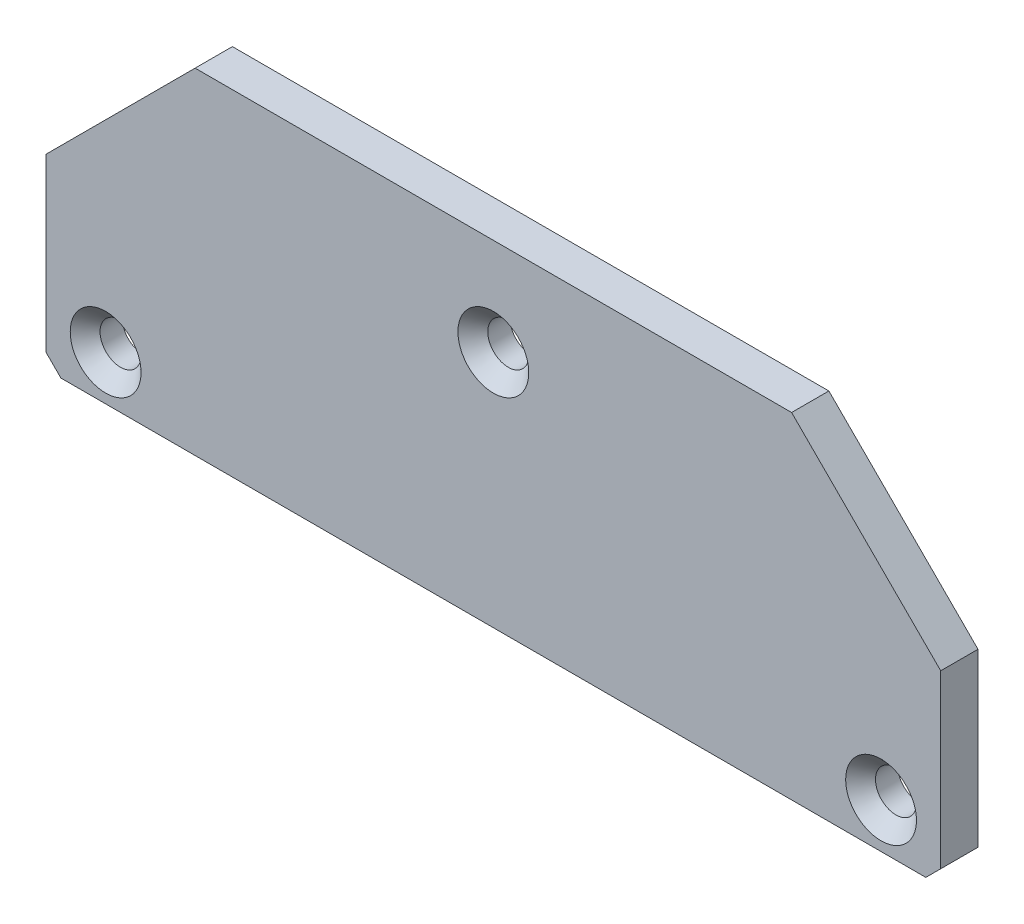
ISO-10303-21;
HEADER;
FILE_DESCRIPTION(('STEP AP214'),'2;1');
FILE_NAME('part.step','',(''),(''),'','','');
FILE_SCHEMA(('AUTOMOTIVE_DESIGN { 1 0 10303 214 1 1 1 1 }'));
ENDSEC;
DATA;
#1=APPLICATION_CONTEXT('core data for automotive mechanical design processes');
#2=APPLICATION_PROTOCOL_DEFINITION('international standard','automotive_design',2000,#1);
#3=PRODUCT_CONTEXT('',#1,'mechanical');
#4=PRODUCT('Part','Part','',(#3));
#5=PRODUCT_RELATED_PRODUCT_CATEGORY('part','',(#4));
#6=PRODUCT_DEFINITION_FORMATION('','',#4);
#7=PRODUCT_DEFINITION_CONTEXT('part definition',#1,'design');
#8=PRODUCT_DEFINITION('design','',#6,#7);
#9=PRODUCT_DEFINITION_SHAPE('','',#8);
#10=(LENGTH_UNIT() NAMED_UNIT(*) SI_UNIT(.MILLI.,.METRE.));
#11=(NAMED_UNIT(*) PLANE_ANGLE_UNIT() SI_UNIT($,.RADIAN.));
#12=(NAMED_UNIT(*) SI_UNIT($,.STERADIAN.) SOLID_ANGLE_UNIT());
#13=UNCERTAINTY_MEASURE_WITH_UNIT(LENGTH_MEASURE(1.E-05),#10,'distance_accuracy_value','');
#14=(GEOMETRIC_REPRESENTATION_CONTEXT(3) GLOBAL_UNCERTAINTY_ASSIGNED_CONTEXT((#13)) GLOBAL_UNIT_ASSIGNED_CONTEXT((#10,
#11,#12)) REPRESENTATION_CONTEXT('',''));
#15=CARTESIAN_POINT('',(0.,0.,0.));
#16=DIRECTION('',(0.,0.,1.));
#17=DIRECTION('',(1.,0.,0.));
#18=AXIS2_PLACEMENT_3D('',#15,#16,#17);
#19=CARTESIAN_POINT('',(60.,12.9332392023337,-7.));
#20=DIRECTION('',(0.,0.,-1.));
#21=DIRECTION('',(-1.,0.,0.));
#22=AXIS2_PLACEMENT_3D('',#19,#20,#21);
#23=PLANE('',#22);
#24=CARTESIAN_POINT('',(-52.,18.9332392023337,-7.));
#25=DIRECTION('',(0.,0.,-1.));
#26=DIRECTION('',(-1.,0.,0.));
#27=AXIS2_PLACEMENT_3D('',#24,#25,#26);
#28=CIRCLE('',#27,2.75);
#29=CARTESIAN_POINT('',(-54.75,18.9332392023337,-7.));
#30=VERTEX_POINT('',#29);
#31=EDGE_CURVE('E240',#30,#30,#28,.T.);
#32=ORIENTED_EDGE('',*,*,#31,.F.);
#33=EDGE_LOOP('',(#32));
#34=FACE_BOUND('',#33,.T.);
#35=DIRECTION('',(0.,-1.,0.));
#36=VECTOR('',#35,1.);
#37=CARTESIAN_POINT('',(60.,37.9332392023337,-7.));
#38=LINE('',#37,#36);
#39=CARTESIAN_POINT('',(60.,37.9332392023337,-7.));
#40=VERTEX_POINT('',#39);
#41=CARTESIAN_POINT('',(60.,14.9332392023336,-7.));
#42=VERTEX_POINT('',#41);
#43=EDGE_CURVE('E142',#40,#42,#38,.T.);
#44=ORIENTED_EDGE('',*,*,#43,.T.);
#45=DIRECTION('',(0.707106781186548,0.707106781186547,0.));
#46=VECTOR('',#45,1.);
#47=CARTESIAN_POINT('',(59.,13.9332392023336,-7.));
#48=LINE('',#47,#46);
#49=CARTESIAN_POINT('',(58.,12.9332392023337,-7.));
#50=VERTEX_POINT('',#49);
#51=EDGE_CURVE('E41',#42,#50,#48,.F.);
#52=ORIENTED_EDGE('',*,*,#51,.T.);
#53=DIRECTION('',(-1.,0.,0.));
#54=VECTOR('',#53,1.);
#55=CARTESIAN_POINT('',(60.,12.9332392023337,-7.));
#56=LINE('',#55,#54);
#57=CARTESIAN_POINT('',(-58.,12.9332392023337,-7.));
#58=VERTEX_POINT('',#57);
#59=EDGE_CURVE('E106',#50,#58,#56,.T.);
#60=ORIENTED_EDGE('',*,*,#59,.T.);
#61=DIRECTION('',(0.70710678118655,-0.707106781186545,0.));
#62=VECTOR('',#61,1.);
#63=CARTESIAN_POINT('',(1.00000000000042,-46.0667607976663,-7.));
#64=LINE('',#63,#62);
#65=CARTESIAN_POINT('',(-60.,14.9332392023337,-7.));
#66=VERTEX_POINT('',#65);
#67=EDGE_CURVE('E48',#58,#66,#64,.F.);
#68=ORIENTED_EDGE('',*,*,#67,.T.);
#69=DIRECTION('',(0.,1.,0.));
#70=VECTOR('',#69,1.);
#71=CARTESIAN_POINT('',(-60.,12.9332392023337,-7.));
#72=LINE('',#71,#70);
#73=CARTESIAN_POINT('',(-60.,37.9332392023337,-7.));
#74=VERTEX_POINT('',#73);
#75=EDGE_CURVE('E98',#66,#74,#72,.T.);
#76=ORIENTED_EDGE('',*,*,#75,.T.);
#77=DIRECTION('',(0.707106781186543,0.707106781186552,0.));
#78=VECTOR('',#77,1.);
#79=CARTESIAN_POINT('',(-60.,37.9332392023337,-7.));
#80=LINE('',#79,#78);
#81=CARTESIAN_POINT('',(-40.0000000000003,57.9332392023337,-7.));
#82=VERTEX_POINT('',#81);
#83=EDGE_CURVE('E102',#74,#82,#80,.T.);
#84=ORIENTED_EDGE('',*,*,#83,.T.);
#85=DIRECTION('',(1.,0.,0.));
#86=VECTOR('',#85,1.);
#87=CARTESIAN_POINT('',(-40.0000000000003,57.9332392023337,-7.));
#88=LINE('',#87,#86);
#89=CARTESIAN_POINT('',(40.0000000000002,57.9332392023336,-7.));
#90=VERTEX_POINT('',#89);
#91=EDGE_CURVE('E121',#82,#90,#88,.T.);
#92=ORIENTED_EDGE('',*,*,#91,.T.);
#93=DIRECTION('',(0.707106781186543,-0.707106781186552,0.));
#94=VECTOR('',#93,1.);
#95=CARTESIAN_POINT('',(60.,37.9332392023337,-7.));
#96=LINE('',#95,#94);
#97=EDGE_CURVE('E123',#90,#40,#96,.T.);
#98=ORIENTED_EDGE('',*,*,#97,.T.);
#99=EDGE_LOOP('',(#44,#52,#60,#68,#76,#84,#92,#98));
#100=FACE_BOUND('',#99,.T.);
#101=CARTESIAN_POINT('',(52.,18.9332392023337,-7.));
#102=DIRECTION('',(0.,0.,-1.));
#103=DIRECTION('',(-1.,0.,0.));
#104=AXIS2_PLACEMENT_3D('',#101,#102,#103);
#105=CIRCLE('',#104,2.75);
#106=CARTESIAN_POINT('',(49.25,18.9332392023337,-7.));
#107=VERTEX_POINT('',#106);
#108=EDGE_CURVE('E132',#107,#107,#105,.T.);
#109=ORIENTED_EDGE('',*,*,#108,.F.);
#110=EDGE_LOOP('',(#109));
#111=FACE_BOUND('',#110,.T.);
#112=CARTESIAN_POINT('',(0.,44.9332392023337,-7.));
#113=DIRECTION('',(0.,0.,-1.));
#114=DIRECTION('',(-1.,0.,0.));
#115=AXIS2_PLACEMENT_3D('',#112,#113,#114);
#116=CIRCLE('',#115,2.75);
#117=CARTESIAN_POINT('',(-2.75,44.9332392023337,-7.));
#118=VERTEX_POINT('',#117);
#119=EDGE_CURVE('E238',#118,#118,#116,.T.);
#120=ORIENTED_EDGE('',*,*,#119,.F.);
#121=EDGE_LOOP('',(#120));
#122=FACE_BOUND('',#121,.T.);
#123=ADVANCED_FACE('F33',(#34,#100,#111,#122),#23,.T.);
#124=CARTESIAN_POINT('',(60.,12.9332392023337,-2.));
#125=DIRECTION('',(0.,0.,-1.));
#126=DIRECTION('',(-1.,0.,0.));
#127=AXIS2_PLACEMENT_3D('',#124,#125,#126);
#128=PLANE('',#127);
#129=CARTESIAN_POINT('',(52.,18.9332392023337,-2.));
#130=DIRECTION('',(0.,0.,-1.));
#131=DIRECTION('',(-1.,0.,0.));
#132=AXIS2_PLACEMENT_3D('',#129,#130,#131);
#133=CIRCLE('',#132,4.74999999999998);
#134=CARTESIAN_POINT('',(47.25,18.9332392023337,-2.));
#135=VERTEX_POINT('',#134);
#136=EDGE_CURVE('E154',#135,#135,#133,.T.);
#137=ORIENTED_EDGE('',*,*,#136,.T.);
#138=EDGE_LOOP('',(#137));
#139=FACE_BOUND('',#138,.T.);
#140=CARTESIAN_POINT('',(0.,44.9332392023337,-2.));
#141=DIRECTION('',(0.,0.,-1.));
#142=DIRECTION('',(-1.,0.,0.));
#143=AXIS2_PLACEMENT_3D('',#140,#141,#142);
#144=CIRCLE('',#143,4.74999999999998);
#145=CARTESIAN_POINT('',(-4.74999999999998,44.9332392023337,-2.));
#146=VERTEX_POINT('',#145);
#147=EDGE_CURVE('E151',#146,#146,#144,.T.);
#148=ORIENTED_EDGE('',*,*,#147,.T.);
#149=EDGE_LOOP('',(#148));
#150=FACE_BOUND('',#149,.T.);
#151=CARTESIAN_POINT('',(-52.,18.9332392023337,-2.));
#152=DIRECTION('',(0.,0.,-1.));
#153=DIRECTION('',(-1.,0.,0.));
#154=AXIS2_PLACEMENT_3D('',#151,#152,#153);
#155=CIRCLE('',#154,4.74999999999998);
#156=CARTESIAN_POINT('',(-56.75,18.9332392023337,-2.));
#157=VERTEX_POINT('',#156);
#158=EDGE_CURVE('E115',#157,#157,#155,.T.);
#159=ORIENTED_EDGE('',*,*,#158,.T.);
#160=EDGE_LOOP('',(#159));
#161=FACE_BOUND('',#160,.T.);
#162=DIRECTION('',(-1.,0.,0.));
#163=VECTOR('',#162,1.);
#164=CARTESIAN_POINT('',(60.,12.9332392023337,-2.));
#165=LINE('',#164,#163);
#166=CARTESIAN_POINT('',(58.,12.9332392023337,-2.));
#167=VERTEX_POINT('',#166);
#168=CARTESIAN_POINT('',(-58.,12.9332392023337,-2.));
#169=VERTEX_POINT('',#168);
#170=EDGE_CURVE('E131',#167,#169,#165,.T.);
#171=ORIENTED_EDGE('',*,*,#170,.F.);
#172=DIRECTION('',(-0.707106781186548,-0.707106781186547,0.));
#173=VECTOR('',#172,1.);
#174=CARTESIAN_POINT('',(58.,12.9332392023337,-2.));
#175=LINE('',#174,#173);
#176=CARTESIAN_POINT('',(60.,14.9332392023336,-2.));
#177=VERTEX_POINT('',#176);
#178=EDGE_CURVE('E173',#167,#177,#175,.F.);
#179=ORIENTED_EDGE('',*,*,#178,.T.);
#180=DIRECTION('',(0.,-1.,0.));
#181=VECTOR('',#180,1.);
#182=CARTESIAN_POINT('',(60.,37.9332392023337,-2.));
#183=LINE('',#182,#181);
#184=CARTESIAN_POINT('',(60.,37.9332392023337,-2.));
#185=VERTEX_POINT('',#184);
#186=EDGE_CURVE('E129',#185,#177,#183,.T.);
#187=ORIENTED_EDGE('',*,*,#186,.F.);
#188=DIRECTION('',(0.707106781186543,-0.707106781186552,0.));
#189=VECTOR('',#188,1.);
#190=CARTESIAN_POINT('',(60.,37.9332392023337,-2.));
#191=LINE('',#190,#189);
#192=CARTESIAN_POINT('',(40.0000000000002,57.9332392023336,-2.));
#193=VERTEX_POINT('',#192);
#194=EDGE_CURVE('E140',#193,#185,#191,.T.);
#195=ORIENTED_EDGE('',*,*,#194,.F.);
#196=DIRECTION('',(1.,0.,0.));
#197=VECTOR('',#196,1.);
#198=CARTESIAN_POINT('',(-40.0000000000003,57.9332392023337,-2.));
#199=LINE('',#198,#197);
#200=CARTESIAN_POINT('',(-40.0000000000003,57.9332392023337,-2.));
#201=VERTEX_POINT('',#200);
#202=EDGE_CURVE('E138',#201,#193,#199,.T.);
#203=ORIENTED_EDGE('',*,*,#202,.F.);
#204=DIRECTION('',(0.707106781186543,0.707106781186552,0.));
#205=VECTOR('',#204,1.);
#206=CARTESIAN_POINT('',(-60.,37.9332392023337,-2.));
#207=LINE('',#206,#205);
#208=CARTESIAN_POINT('',(-60.,37.9332392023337,-2.));
#209=VERTEX_POINT('',#208);
#210=EDGE_CURVE('E136',#209,#201,#207,.T.);
#211=ORIENTED_EDGE('',*,*,#210,.F.);
#212=DIRECTION('',(0.,1.,0.));
#213=VECTOR('',#212,1.);
#214=CARTESIAN_POINT('',(-60.,12.9332392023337,-2.));
#215=LINE('',#214,#213);
#216=CARTESIAN_POINT('',(-60.,14.9332392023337,-2.));
#217=VERTEX_POINT('',#216);
#218=EDGE_CURVE('E112',#217,#209,#215,.T.);
#219=ORIENTED_EDGE('',*,*,#218,.F.);
#220=DIRECTION('',(-0.70710678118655,0.707106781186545,0.));
#221=VECTOR('',#220,1.);
#222=CARTESIAN_POINT('',(-60.,14.9332392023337,-2.));
#223=LINE('',#222,#221);
#224=EDGE_CURVE('E171',#217,#169,#223,.F.);
#225=ORIENTED_EDGE('',*,*,#224,.T.);
#226=EDGE_LOOP('',(#171,#179,#187,#195,#203,#211,#219,#225));
#227=FACE_BOUND('',#226,.T.);
#228=ADVANCED_FACE('F187',(#139,#150,#161,#227),#128,.F.);
#229=CARTESIAN_POINT('',(60.,37.9332392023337,-7.));
#230=DIRECTION('',(-1.,0.,0.));
#231=DIRECTION('',(0.,0.,1.));
#232=AXIS2_PLACEMENT_3D('',#229,#230,#231);
#233=PLANE('',#232);
#234=ORIENTED_EDGE('',*,*,#186,.T.);
#235=DIRECTION('',(0.,0.,-1.));
#236=VECTOR('',#235,1.);
#237=CARTESIAN_POINT('',(60.,14.9332392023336,-7.));
#238=LINE('',#237,#236);
#239=EDGE_CURVE('E56',#177,#42,#238,.T.);
#240=ORIENTED_EDGE('',*,*,#239,.T.);
#241=ORIENTED_EDGE('',*,*,#43,.F.);
#242=DIRECTION('',(0.,0.,1.));
#243=VECTOR('',#242,1.);
#244=CARTESIAN_POINT('',(60.,37.9332392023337,-7.));
#245=LINE('',#244,#243);
#246=EDGE_CURVE('E128',#40,#185,#245,.T.);
#247=ORIENTED_EDGE('',*,*,#246,.T.);
#248=EDGE_LOOP('',(#234,#240,#241,#247));
#249=FACE_BOUND('',#248,.T.);
#250=ADVANCED_FACE('F189',(#249),#233,.F.);
#251=CARTESIAN_POINT('',(60.,12.9332392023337,-7.));
#252=DIRECTION('',(0.,1.,0.));
#253=DIRECTION('',(0.,0.,1.));
#254=AXIS2_PLACEMENT_3D('',#251,#252,#253);
#255=PLANE('',#254);
#256=ORIENTED_EDGE('',*,*,#59,.F.);
#257=DIRECTION('',(0.,0.,1.));
#258=VECTOR('',#257,1.);
#259=CARTESIAN_POINT('',(58.,12.9332392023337,-7.));
#260=LINE('',#259,#258);
#261=EDGE_CURVE('E168',#50,#167,#260,.T.);
#262=ORIENTED_EDGE('',*,*,#261,.T.);
#263=ORIENTED_EDGE('',*,*,#170,.T.);
#264=DIRECTION('',(0.,0.,-1.));
#265=VECTOR('',#264,1.);
#266=CARTESIAN_POINT('',(-58.,12.9332392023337,-7.));
#267=LINE('',#266,#265);
#268=EDGE_CURVE('E166',#169,#58,#267,.T.);
#269=ORIENTED_EDGE('',*,*,#268,.T.);
#270=EDGE_LOOP('',(#256,#262,#263,#269));
#271=FACE_BOUND('',#270,.T.);
#272=ADVANCED_FACE('F181',(#271),#255,.F.);
#273=CARTESIAN_POINT('',(-60.,12.9332392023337,-7.));
#274=DIRECTION('',(1.,0.,0.));
#275=DIRECTION('',(0.,0.,-1.));
#276=AXIS2_PLACEMENT_3D('',#273,#274,#275);
#277=PLANE('',#276);
#278=ORIENTED_EDGE('',*,*,#75,.F.);
#279=DIRECTION('',(0.,0.,1.));
#280=VECTOR('',#279,1.);
#281=CARTESIAN_POINT('',(-60.,14.9332392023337,-7.));
#282=LINE('',#281,#280);
#283=EDGE_CURVE('E11',#66,#217,#282,.T.);
#284=ORIENTED_EDGE('',*,*,#283,.T.);
#285=ORIENTED_EDGE('',*,*,#218,.T.);
#286=DIRECTION('',(0.,0.,1.));
#287=VECTOR('',#286,1.);
#288=CARTESIAN_POINT('',(-60.,37.9332392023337,-7.));
#289=LINE('',#288,#287);
#290=EDGE_CURVE('E109',#74,#209,#289,.T.);
#291=ORIENTED_EDGE('',*,*,#290,.F.);
#292=EDGE_LOOP('',(#278,#284,#285,#291));
#293=FACE_BOUND('',#292,.T.);
#294=ADVANCED_FACE('F110',(#293),#277,.F.);
#295=CARTESIAN_POINT('',(-60.,37.9332392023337,-7.));
#296=DIRECTION('',(0.707106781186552,-0.707106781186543,0.));
#297=DIRECTION('',(0.707106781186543,0.707106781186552,0.));
#298=AXIS2_PLACEMENT_3D('',#295,#296,#297);
#299=PLANE('',#298);
#300=ORIENTED_EDGE('',*,*,#210,.T.);
#301=DIRECTION('',(0.,0.,1.));
#302=VECTOR('',#301,1.);
#303=CARTESIAN_POINT('',(-40.0000000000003,57.9332392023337,-7.));
#304=LINE('',#303,#302);
#305=EDGE_CURVE('E116',#82,#201,#304,.T.);
#306=ORIENTED_EDGE('',*,*,#305,.F.);
#307=ORIENTED_EDGE('',*,*,#83,.F.);
#308=ORIENTED_EDGE('',*,*,#290,.T.);
#309=EDGE_LOOP('',(#300,#306,#307,#308));
#310=FACE_BOUND('',#309,.T.);
#311=ADVANCED_FACE('F118',(#310),#299,.F.);
#312=CARTESIAN_POINT('',(-40.0000000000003,57.9332392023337,-7.));
#313=DIRECTION('',(0.,-1.,0.));
#314=DIRECTION('',(1.,0.,0.));
#315=AXIS2_PLACEMENT_3D('',#312,#313,#314);
#316=PLANE('',#315);
#317=ORIENTED_EDGE('',*,*,#202,.T.);
#318=DIRECTION('',(0.,0.,1.));
#319=VECTOR('',#318,1.);
#320=CARTESIAN_POINT('',(40.0000000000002,57.9332392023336,-7.));
#321=LINE('',#320,#319);
#322=EDGE_CURVE('E145',#90,#193,#321,.T.);
#323=ORIENTED_EDGE('',*,*,#322,.F.);
#324=ORIENTED_EDGE('',*,*,#91,.F.);
#325=ORIENTED_EDGE('',*,*,#305,.T.);
#326=EDGE_LOOP('',(#317,#323,#324,#325));
#327=FACE_BOUND('',#326,.T.);
#328=ADVANCED_FACE('F197',(#327),#316,.F.);
#329=CARTESIAN_POINT('',(60.,37.9332392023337,-7.));
#330=DIRECTION('',(-0.707106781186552,-0.707106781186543,0.));
#331=DIRECTION('',(0.707106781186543,-0.707106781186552,0.));
#332=AXIS2_PLACEMENT_3D('',#329,#330,#331);
#333=PLANE('',#332);
#334=ORIENTED_EDGE('',*,*,#194,.T.);
#335=ORIENTED_EDGE('',*,*,#246,.F.);
#336=ORIENTED_EDGE('',*,*,#97,.F.);
#337=ORIENTED_EDGE('',*,*,#322,.T.);
#338=EDGE_LOOP('',(#334,#335,#336,#337));
#339=FACE_BOUND('',#338,.T.);
#340=ADVANCED_FACE('F193',(#339),#333,.F.);
#341=CARTESIAN_POINT('',(52.,18.9332392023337,-7.));
#342=DIRECTION('',(0.,0.,1.));
#343=DIRECTION('',(1.,0.,0.));
#344=AXIS2_PLACEMENT_3D('',#341,#342,#343);
#345=CYLINDRICAL_SURFACE('',#344,2.75);
#346=CARTESIAN_POINT('',(52.,18.9332392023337,-3.99999999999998));
#347=DIRECTION('',(0.,0.,-1.));
#348=DIRECTION('',(-1.,0.,0.));
#349=AXIS2_PLACEMENT_3D('',#346,#347,#348);
#350=CIRCLE('',#349,2.75);
#351=CARTESIAN_POINT('',(49.25,18.9332392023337,-3.99999999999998));
#352=VERTEX_POINT('',#351);
#353=EDGE_CURVE('E157',#352,#352,#350,.F.);
#354=ORIENTED_EDGE('',*,*,#353,.T.);
#355=EDGE_LOOP('',(#354));
#356=FACE_BOUND('',#355,.T.);
#357=ORIENTED_EDGE('',*,*,#108,.T.);
#358=EDGE_LOOP('',(#357));
#359=FACE_BOUND('',#358,.T.);
#360=ADVANCED_FACE('F204',(#356,#359),#345,.F.);
#361=CARTESIAN_POINT('',(-52.,18.9332392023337,-7.));
#362=DIRECTION('',(0.,0.,1.));
#363=DIRECTION('',(1.,0.,0.));
#364=AXIS2_PLACEMENT_3D('',#361,#362,#363);
#365=CYLINDRICAL_SURFACE('',#364,2.75);
#366=CARTESIAN_POINT('',(-52.,18.9332392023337,-3.99999999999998));
#367=DIRECTION('',(0.,0.,-1.));
#368=DIRECTION('',(-1.,0.,0.));
#369=AXIS2_PLACEMENT_3D('',#366,#367,#368);
#370=CIRCLE('',#369,2.75);
#371=CARTESIAN_POINT('',(-54.75,18.9332392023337,-3.99999999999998));
#372=VERTEX_POINT('',#371);
#373=EDGE_CURVE('E163',#372,#372,#370,.F.);
#374=ORIENTED_EDGE('',*,*,#373,.T.);
#375=EDGE_LOOP('',(#374));
#376=FACE_BOUND('',#375,.T.);
#377=ORIENTED_EDGE('',*,*,#31,.T.);
#378=EDGE_LOOP('',(#377));
#379=FACE_BOUND('',#378,.T.);
#380=ADVANCED_FACE('F219',(#376,#379),#365,.F.);
#381=CARTESIAN_POINT('',(0.,44.9332392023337,-7.));
#382=DIRECTION('',(0.,0.,1.));
#383=DIRECTION('',(1.,0.,0.));
#384=AXIS2_PLACEMENT_3D('',#381,#382,#383);
#385=CYLINDRICAL_SURFACE('',#384,2.75);
#386=CARTESIAN_POINT('',(0.,44.9332392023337,-3.99999999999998));
#387=DIRECTION('',(0.,0.,-1.));
#388=DIRECTION('',(-1.,0.,0.));
#389=AXIS2_PLACEMENT_3D('',#386,#387,#388);
#390=CIRCLE('',#389,2.75);
#391=CARTESIAN_POINT('',(-2.75,44.9332392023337,-3.99999999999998));
#392=VERTEX_POINT('',#391);
#393=EDGE_CURVE('E160',#392,#392,#390,.F.);
#394=ORIENTED_EDGE('',*,*,#393,.T.);
#395=EDGE_LOOP('',(#394));
#396=FACE_BOUND('',#395,.T.);
#397=ORIENTED_EDGE('',*,*,#119,.T.);
#398=EDGE_LOOP('',(#397));
#399=FACE_BOUND('',#398,.T.);
#400=ADVANCED_FACE('F223',(#396,#399),#385,.F.);
#401=CARTESIAN_POINT('',(52.,18.9332392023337,-2.));
#402=DIRECTION('',(0.,0.,1.));
#403=DIRECTION('',(1.,0.,0.));
#404=AXIS2_PLACEMENT_3D('',#401,#402,#403);
#405=CONICAL_SURFACE('',#404,4.74999999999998,0.785398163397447);
#406=ORIENTED_EDGE('',*,*,#353,.F.);
#407=EDGE_LOOP('',(#406));
#408=FACE_BOUND('',#407,.T.);
#409=ORIENTED_EDGE('',*,*,#136,.F.);
#410=EDGE_LOOP('',(#409));
#411=FACE_BOUND('',#410,.T.);
#412=ADVANCED_FACE('F226',(#408,#411),#405,.F.);
#413=CARTESIAN_POINT('',(0.,44.9332392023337,-2.));
#414=DIRECTION('',(0.,0.,1.));
#415=DIRECTION('',(1.,0.,0.));
#416=AXIS2_PLACEMENT_3D('',#413,#414,#415);
#417=CONICAL_SURFACE('',#416,4.74999999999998,0.785398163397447);
#418=ORIENTED_EDGE('',*,*,#393,.F.);
#419=EDGE_LOOP('',(#418));
#420=FACE_BOUND('',#419,.T.);
#421=ORIENTED_EDGE('',*,*,#147,.F.);
#422=EDGE_LOOP('',(#421));
#423=FACE_BOUND('',#422,.T.);
#424=ADVANCED_FACE('F231',(#420,#423),#417,.F.);
#425=CARTESIAN_POINT('',(-52.,18.9332392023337,-2.));
#426=DIRECTION('',(0.,0.,1.));
#427=DIRECTION('',(1.,0.,0.));
#428=AXIS2_PLACEMENT_3D('',#425,#426,#427);
#429=CONICAL_SURFACE('',#428,4.74999999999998,0.785398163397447);
#430=ORIENTED_EDGE('',*,*,#373,.F.);
#431=EDGE_LOOP('',(#430));
#432=FACE_BOUND('',#431,.T.);
#433=ORIENTED_EDGE('',*,*,#158,.F.);
#434=EDGE_LOOP('',(#433));
#435=FACE_BOUND('',#434,.T.);
#436=ADVANCED_FACE('F253',(#432,#435),#429,.F.);
#437=CARTESIAN_POINT('',(58.,12.9332392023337,-7.));
#438=DIRECTION('',(-0.707106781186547,0.707106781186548,0.));
#439=DIRECTION('',(-0.707106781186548,-0.707106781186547,0.));
#440=AXIS2_PLACEMENT_3D('',#437,#438,#439);
#441=PLANE('',#440);
#442=ORIENTED_EDGE('',*,*,#51,.F.);
#443=ORIENTED_EDGE('',*,*,#239,.F.);
#444=ORIENTED_EDGE('',*,*,#178,.F.);
#445=ORIENTED_EDGE('',*,*,#261,.F.);
#446=EDGE_LOOP('',(#442,#443,#444,#445));
#447=FACE_BOUND('',#446,.T.);
#448=ADVANCED_FACE('F184',(#447),#441,.F.);
#449=CARTESIAN_POINT('',(-60.,14.9332392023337,-7.));
#450=DIRECTION('',(0.707106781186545,0.70710678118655,0.));
#451=DIRECTION('',(-0.70710678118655,0.707106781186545,0.));
#452=AXIS2_PLACEMENT_3D('',#449,#450,#451);
#453=PLANE('',#452);
#454=ORIENTED_EDGE('',*,*,#67,.F.);
#455=ORIENTED_EDGE('',*,*,#268,.F.);
#456=ORIENTED_EDGE('',*,*,#224,.F.);
#457=ORIENTED_EDGE('',*,*,#283,.F.);
#458=EDGE_LOOP('',(#454,#455,#456,#457));
#459=FACE_BOUND('',#458,.T.);
#460=ADVANCED_FACE('F35',(#459),#453,.F.);
#461=CLOSED_SHELL('',(#123,#228,#250,#272,#294,#311,#328,#340,#360,#380,#400,#412,#424,#436,
#448,#460));
#462=MANIFOLD_SOLID_BREP('B2',#461);
#463=ADVANCED_BREP_SHAPE_REPRESENTATION('',(#18,#462),#14);
#464=SHAPE_DEFINITION_REPRESENTATION(#9,#463);
ENDSEC;
END-ISO-10303-21;
